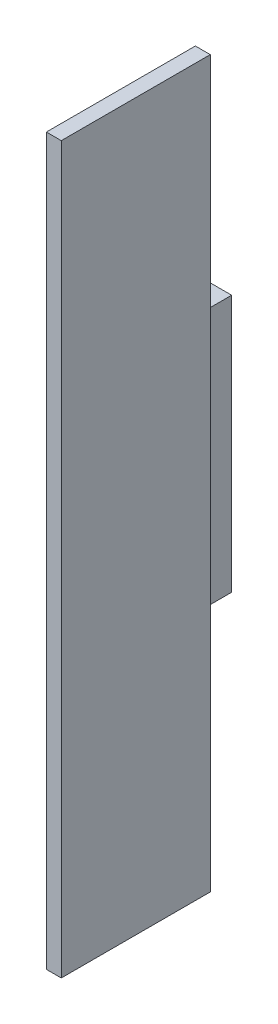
ISO-10303-21;
HEADER;
FILE_DESCRIPTION(('STEP AP214'),'2;1');
FILE_NAME('part.step','',(''),(''),'','','');
FILE_SCHEMA(('AUTOMOTIVE_DESIGN { 1 0 10303 214 1 1 1 1 }'));
ENDSEC;
DATA;
#1=APPLICATION_CONTEXT('core data for automotive mechanical design processes');
#2=APPLICATION_PROTOCOL_DEFINITION('international standard','automotive_design',2000,#1);
#3=PRODUCT_CONTEXT('',#1,'mechanical');
#4=PRODUCT('Part','Part','',(#3));
#5=PRODUCT_RELATED_PRODUCT_CATEGORY('part','',(#4));
#6=PRODUCT_DEFINITION_FORMATION('','',#4);
#7=PRODUCT_DEFINITION_CONTEXT('part definition',#1,'design');
#8=PRODUCT_DEFINITION('design','',#6,#7);
#9=PRODUCT_DEFINITION_SHAPE('','',#8);
#10=(LENGTH_UNIT() NAMED_UNIT(*) SI_UNIT(.MILLI.,.METRE.));
#11=(NAMED_UNIT(*) PLANE_ANGLE_UNIT() SI_UNIT($,.RADIAN.));
#12=(NAMED_UNIT(*) SI_UNIT($,.STERADIAN.) SOLID_ANGLE_UNIT());
#13=UNCERTAINTY_MEASURE_WITH_UNIT(LENGTH_MEASURE(1.E-05),#10,'distance_accuracy_value','');
#14=(GEOMETRIC_REPRESENTATION_CONTEXT(3) GLOBAL_UNCERTAINTY_ASSIGNED_CONTEXT((#13)) GLOBAL_UNIT_ASSIGNED_CONTEXT((#10,
#11,#12)) REPRESENTATION_CONTEXT('',''));
#15=CARTESIAN_POINT('',(0.,0.,0.));
#16=DIRECTION('',(0.,0.,1.));
#17=DIRECTION('',(1.,0.,0.));
#18=AXIS2_PLACEMENT_3D('',#15,#16,#17);
#19=CARTESIAN_POINT('',(0.,73.,30.));
#20=DIRECTION('',(-1.,0.,0.));
#21=DIRECTION('',(0.,-1.,0.));
#22=AXIS2_PLACEMENT_3D('',#19,#20,#21);
#23=PLANE('',#22);
#24=DIRECTION('',(0.,-1.,0.));
#25=VECTOR('',#24,1.);
#26=CARTESIAN_POINT('',(0.,-35.,7.69999999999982));
#27=LINE('',#26,#25);
#28=CARTESIAN_POINT('',(0.,35.,7.69999999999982));
#29=VERTEX_POINT('',#28);
#30=CARTESIAN_POINT('',(0.,-35.,7.69999999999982));
#31=VERTEX_POINT('',#30);
#32=EDGE_CURVE('E32',#29,#31,#27,.T.);
#33=ORIENTED_EDGE('',*,*,#32,.T.);
#34=DIRECTION('',(0.,0.,-1.));
#35=VECTOR('',#34,1.);
#36=CARTESIAN_POINT('',(0.,-35.,0.));
#37=LINE('',#36,#35);
#38=CARTESIAN_POINT('',(0.,-35.,0.));
#39=VERTEX_POINT('',#38);
#40=EDGE_CURVE('E18',#31,#39,#37,.T.);
#41=ORIENTED_EDGE('',*,*,#40,.T.);
#42=DIRECTION('',(0.,1.,0.));
#43=VECTOR('',#42,1.);
#44=CARTESIAN_POINT('',(0.,-73.,0.));
#45=LINE('',#44,#43);
#46=CARTESIAN_POINT('',(0.,-73.,0.));
#47=VERTEX_POINT('',#46);
#48=EDGE_CURVE('E178',#47,#39,#45,.T.);
#49=ORIENTED_EDGE('',*,*,#48,.F.);
#50=DIRECTION('',(0.,0.,-1.));
#51=VECTOR('',#50,1.);
#52=CARTESIAN_POINT('',(0.,-73.,30.));
#53=LINE('',#52,#51);
#54=CARTESIAN_POINT('',(0.,-73.,30.));
#55=VERTEX_POINT('',#54);
#56=EDGE_CURVE('E165',#55,#47,#53,.T.);
#57=ORIENTED_EDGE('',*,*,#56,.F.);
#58=DIRECTION('',(0.,-1.,0.));
#59=VECTOR('',#58,1.);
#60=CARTESIAN_POINT('',(0.,73.,30.));
#61=LINE('',#60,#59);
#62=CARTESIAN_POINT('',(0.,73.,30.));
#63=VERTEX_POINT('',#62);
#64=EDGE_CURVE('E155',#63,#55,#61,.T.);
#65=ORIENTED_EDGE('',*,*,#64,.F.);
#66=DIRECTION('',(0.,0.,1.));
#67=VECTOR('',#66,1.);
#68=CARTESIAN_POINT('',(0.,73.,0.));
#69=LINE('',#68,#67);
#70=CARTESIAN_POINT('',(0.,73.,0.));
#71=VERTEX_POINT('',#70);
#72=EDGE_CURVE('E170',#71,#63,#69,.T.);
#73=ORIENTED_EDGE('',*,*,#72,.F.);
#74=CARTESIAN_POINT('',(0.,34.9999999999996,0.));
#75=VERTEX_POINT('',#74);
#76=EDGE_CURVE('E167',#75,#71,#45,.T.);
#77=ORIENTED_EDGE('',*,*,#76,.F.);
#78=DIRECTION('',(0.,0.,1.));
#79=VECTOR('',#78,1.);
#80=CARTESIAN_POINT('',(0.,35.,7.69999999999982));
#81=LINE('',#80,#79);
#82=EDGE_CURVE('E125',#75,#29,#81,.T.);
#83=ORIENTED_EDGE('',*,*,#82,.T.);
#84=EDGE_LOOP('',(#33,#41,#49,#57,#65,#73,#77,#83));
#85=FACE_BOUND('',#84,.T.);
#86=ADVANCED_FACE('F14',(#85),#23,.T.);
#87=CARTESIAN_POINT('',(3.,73.,30.));
#88=DIRECTION('',(0.,0.,-1.));
#89=DIRECTION('',(0.,1.,0.));
#90=AXIS2_PLACEMENT_3D('',#87,#88,#89);
#91=PLANE('',#90);
#92=ORIENTED_EDGE('',*,*,#64,.T.);
#93=DIRECTION('',(-1.,0.,0.));
#94=VECTOR('',#93,1.);
#95=CARTESIAN_POINT('',(3.,-73.,30.));
#96=LINE('',#95,#94);
#97=CARTESIAN_POINT('',(3.,-73.,30.));
#98=VERTEX_POINT('',#97);
#99=EDGE_CURVE('E9',#98,#55,#96,.T.);
#100=ORIENTED_EDGE('',*,*,#99,.F.);
#101=DIRECTION('',(0.,-1.,0.));
#102=VECTOR('',#101,1.);
#103=CARTESIAN_POINT('',(3.,73.,30.));
#104=LINE('',#103,#102);
#105=CARTESIAN_POINT('',(3.,73.,30.));
#106=VERTEX_POINT('',#105);
#107=EDGE_CURVE('E196',#106,#98,#104,.T.);
#108=ORIENTED_EDGE('',*,*,#107,.F.);
#109=DIRECTION('',(-1.,0.,0.));
#110=VECTOR('',#109,1.);
#111=CARTESIAN_POINT('',(3.,73.,30.));
#112=LINE('',#111,#110);
#113=EDGE_CURVE('E193',#106,#63,#112,.T.);
#114=ORIENTED_EDGE('',*,*,#113,.T.);
#115=EDGE_LOOP('',(#92,#100,#108,#114));
#116=FACE_BOUND('',#115,.T.);
#117=ADVANCED_FACE('F16',(#116),#91,.F.);
#118=CARTESIAN_POINT('',(3.,-73.,30.));
#119=DIRECTION('',(0.,1.,0.));
#120=DIRECTION('',(-1.,0.,0.));
#121=AXIS2_PLACEMENT_3D('',#118,#119,#120);
#122=PLANE('',#121);
#123=ORIENTED_EDGE('',*,*,#56,.T.);
#124=DIRECTION('',(-1.,0.,0.));
#125=VECTOR('',#124,1.);
#126=CARTESIAN_POINT('',(3.,-73.,0.));
#127=LINE('',#126,#125);
#128=CARTESIAN_POINT('',(3.,-73.,0.));
#129=VERTEX_POINT('',#128);
#130=EDGE_CURVE('E24',#129,#47,#127,.T.);
#131=ORIENTED_EDGE('',*,*,#130,.F.);
#132=DIRECTION('',(0.,0.,-1.));
#133=VECTOR('',#132,1.);
#134=CARTESIAN_POINT('',(3.,-73.,30.));
#135=LINE('',#134,#133);
#136=EDGE_CURVE('E197',#98,#129,#135,.T.);
#137=ORIENTED_EDGE('',*,*,#136,.F.);
#138=ORIENTED_EDGE('',*,*,#99,.T.);
#139=EDGE_LOOP('',(#123,#131,#137,#138));
#140=FACE_BOUND('',#139,.T.);
#141=ADVANCED_FACE('F208',(#140),#122,.F.);
#142=CARTESIAN_POINT('',(3.,-73.,0.));
#143=DIRECTION('',(0.,0.,1.));
#144=DIRECTION('',(1.,0.,0.));
#145=AXIS2_PLACEMENT_3D('',#142,#143,#144);
#146=PLANE('',#145);
#147=ORIENTED_EDGE('',*,*,#48,.T.);
#148=DIRECTION('',(1.,0.,0.));
#149=VECTOR('',#148,1.);
#150=CARTESIAN_POINT('',(-6.,-35.,0.));
#151=LINE('',#150,#149);
#152=CARTESIAN_POINT('',(-6.,-35.,0.));
#153=VERTEX_POINT('',#152);
#154=EDGE_CURVE('E113',#153,#39,#151,.T.);
#155=ORIENTED_EDGE('',*,*,#154,.F.);
#156=DIRECTION('',(0.,1.,0.));
#157=VECTOR('',#156,1.);
#158=CARTESIAN_POINT('',(-6.,-35.,0.));
#159=LINE('',#158,#157);
#160=CARTESIAN_POINT('',(-6.,-25.9,0.));
#161=VERTEX_POINT('',#160);
#162=EDGE_CURVE('E136',#153,#161,#159,.T.);
#163=ORIENTED_EDGE('',*,*,#162,.T.);
#164=DIRECTION('',(1.,0.,0.));
#165=VECTOR('',#164,1.);
#166=CARTESIAN_POINT('',(-6.,-25.9,0.));
#167=LINE('',#166,#165);
#168=CARTESIAN_POINT('',(0.,-25.9,0.));
#169=VERTEX_POINT('',#168);
#170=EDGE_CURVE('E161',#161,#169,#167,.T.);
#171=ORIENTED_EDGE('',*,*,#170,.T.);
#172=CARTESIAN_POINT('',(0.,25.9,0.));
#173=VERTEX_POINT('',#172);
#174=EDGE_CURVE('E179',#169,#173,#45,.T.);
#175=ORIENTED_EDGE('',*,*,#174,.T.);
#176=DIRECTION('',(1.,0.,0.));
#177=VECTOR('',#176,1.);
#178=CARTESIAN_POINT('',(-6.,25.9,0.));
#179=LINE('',#178,#177);
#180=CARTESIAN_POINT('',(-6.,25.9,0.));
#181=VERTEX_POINT('',#180);
#182=EDGE_CURVE('E159',#181,#173,#179,.T.);
#183=ORIENTED_EDGE('',*,*,#182,.F.);
#184=DIRECTION('',(0.,1.,0.));
#185=VECTOR('',#184,1.);
#186=CARTESIAN_POINT('',(-6.,25.9,0.));
#187=LINE('',#186,#185);
#188=CARTESIAN_POINT('',(-6.,34.9999999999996,0.));
#189=VERTEX_POINT('',#188);
#190=EDGE_CURVE('E148',#181,#189,#187,.T.);
#191=ORIENTED_EDGE('',*,*,#190,.T.);
#192=DIRECTION('',(1.,0.,0.));
#193=VECTOR('',#192,1.);
#194=CARTESIAN_POINT('',(-6.,34.9999999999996,0.));
#195=LINE('',#194,#193);
#196=EDGE_CURVE('E156',#189,#75,#195,.T.);
#197=ORIENTED_EDGE('',*,*,#196,.T.);
#198=ORIENTED_EDGE('',*,*,#76,.T.);
#199=DIRECTION('',(-1.,0.,0.));
#200=VECTOR('',#199,1.);
#201=CARTESIAN_POINT('',(3.,73.,0.));
#202=LINE('',#201,#200);
#203=CARTESIAN_POINT('',(3.,73.,0.));
#204=VERTEX_POINT('',#203);
#205=EDGE_CURVE('E188',#204,#71,#202,.T.);
#206=ORIENTED_EDGE('',*,*,#205,.F.);
#207=DIRECTION('',(0.,1.,0.));
#208=VECTOR('',#207,1.);
#209=CARTESIAN_POINT('',(3.,-73.,0.));
#210=LINE('',#209,#208);
#211=EDGE_CURVE('E200',#129,#204,#210,.T.);
#212=ORIENTED_EDGE('',*,*,#211,.F.);
#213=ORIENTED_EDGE('',*,*,#130,.T.);
#214=EDGE_LOOP('',(#147,#155,#163,#171,#175,#183,#191,#197,#198,#206,#212,#213));
#215=FACE_BOUND('',#214,.T.);
#216=ADVANCED_FACE('F186',(#215),#146,.F.);
#217=CARTESIAN_POINT('',(3.,73.,0.));
#218=DIRECTION('',(0.,-1.,0.));
#219=DIRECTION('',(1.,0.,0.));
#220=AXIS2_PLACEMENT_3D('',#217,#218,#219);
#221=PLANE('',#220);
#222=ORIENTED_EDGE('',*,*,#72,.T.);
#223=ORIENTED_EDGE('',*,*,#113,.F.);
#224=DIRECTION('',(0.,0.,1.));
#225=VECTOR('',#224,1.);
#226=CARTESIAN_POINT('',(3.,73.,0.));
#227=LINE('',#226,#225);
#228=EDGE_CURVE('E40',#204,#106,#227,.T.);
#229=ORIENTED_EDGE('',*,*,#228,.F.);
#230=ORIENTED_EDGE('',*,*,#205,.T.);
#231=EDGE_LOOP('',(#222,#223,#229,#230));
#232=FACE_BOUND('',#231,.T.);
#233=ADVANCED_FACE('F191',(#232),#221,.F.);
#234=CARTESIAN_POINT('',(3.,73.,30.));
#235=DIRECTION('',(-1.,0.,0.));
#236=DIRECTION('',(0.,-1.,0.));
#237=AXIS2_PLACEMENT_3D('',#234,#235,#236);
#238=PLANE('',#237);
#239=ORIENTED_EDGE('',*,*,#107,.T.);
#240=ORIENTED_EDGE('',*,*,#136,.T.);
#241=ORIENTED_EDGE('',*,*,#211,.T.);
#242=ORIENTED_EDGE('',*,*,#228,.T.);
#243=EDGE_LOOP('',(#239,#240,#241,#242));
#244=FACE_BOUND('',#243,.T.);
#245=ADVANCED_FACE('F224',(#244),#238,.F.);
#246=CARTESIAN_POINT('',(0.,25.9,7.69999999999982));
#247=DIRECTION('',(1.,0.,0.));
#248=DIRECTION('',(0.,1.,0.));
#249=AXIS2_PLACEMENT_3D('',#246,#247,#248);
#250=PLANE('',#249);
#251=ORIENTED_EDGE('',*,*,#174,.F.);
#252=DIRECTION('',(0.,0.,-1.));
#253=VECTOR('',#252,1.);
#254=CARTESIAN_POINT('',(0.,-25.9,0.));
#255=LINE('',#254,#253);
#256=CARTESIAN_POINT('',(0.,-25.9,-7.30000000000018));
#257=VERTEX_POINT('',#256);
#258=EDGE_CURVE('E121',#169,#257,#255,.T.);
#259=ORIENTED_EDGE('',*,*,#258,.T.);
#260=DIRECTION('',(0.,1.,0.));
#261=VECTOR('',#260,1.);
#262=CARTESIAN_POINT('',(0.,-25.9,-7.30000000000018));
#263=LINE('',#262,#261);
#264=CARTESIAN_POINT('',(0.,25.9,-7.30000000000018));
#265=VERTEX_POINT('',#264);
#266=EDGE_CURVE('E129',#257,#265,#263,.T.);
#267=ORIENTED_EDGE('',*,*,#266,.T.);
#268=DIRECTION('',(0.,0.,1.));
#269=VECTOR('',#268,1.);
#270=CARTESIAN_POINT('',(0.,25.9,-7.30000000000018));
#271=LINE('',#270,#269);
#272=EDGE_CURVE('E132',#265,#173,#271,.T.);
#273=ORIENTED_EDGE('',*,*,#272,.T.);
#274=EDGE_LOOP('',(#251,#259,#267,#273));
#275=FACE_BOUND('',#274,.T.);
#276=ADVANCED_FACE('F227',(#275),#250,.T.);
#277=CARTESIAN_POINT('',(-6.,-35.,7.69999999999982));
#278=DIRECTION('',(0.,0.,1.));
#279=DIRECTION('',(1.,0.,0.));
#280=AXIS2_PLACEMENT_3D('',#277,#278,#279);
#281=PLANE('',#280);
#282=ORIENTED_EDGE('',*,*,#32,.F.);
#283=DIRECTION('',(1.,0.,0.));
#284=VECTOR('',#283,1.);
#285=CARTESIAN_POINT('',(-6.,35.,7.69999999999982));
#286=LINE('',#285,#284);
#287=CARTESIAN_POINT('',(-6.,35.,7.69999999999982));
#288=VERTEX_POINT('',#287);
#289=EDGE_CURVE('E153',#288,#29,#286,.T.);
#290=ORIENTED_EDGE('',*,*,#289,.F.);
#291=DIRECTION('',(0.,-1.,0.));
#292=VECTOR('',#291,1.);
#293=CARTESIAN_POINT('',(-6.,-35.,7.69999999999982));
#294=LINE('',#293,#292);
#295=CARTESIAN_POINT('',(-6.,-35.,7.69999999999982));
#296=VERTEX_POINT('',#295);
#297=EDGE_CURVE('E109',#288,#296,#294,.T.);
#298=ORIENTED_EDGE('',*,*,#297,.T.);
#299=DIRECTION('',(1.,0.,0.));
#300=VECTOR('',#299,1.);
#301=CARTESIAN_POINT('',(-6.,-35.,7.69999999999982));
#302=LINE('',#301,#300);
#303=EDGE_CURVE('E105',#296,#31,#302,.T.);
#304=ORIENTED_EDGE('',*,*,#303,.T.);
#305=EDGE_LOOP('',(#282,#290,#298,#304));
#306=FACE_BOUND('',#305,.T.);
#307=ADVANCED_FACE('F107',(#306),#281,.T.);
#308=CARTESIAN_POINT('',(-6.,35.,7.69999999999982));
#309=DIRECTION('',(0.,1.,0.));
#310=DIRECTION('',(0.,0.,1.));
#311=AXIS2_PLACEMENT_3D('',#308,#309,#310);
#312=PLANE('',#311);
#313=ORIENTED_EDGE('',*,*,#82,.F.);
#314=ORIENTED_EDGE('',*,*,#196,.F.);
#315=DIRECTION('',(0.,0.,1.));
#316=VECTOR('',#315,1.);
#317=CARTESIAN_POINT('',(-6.,35.,7.69999999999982));
#318=LINE('',#317,#316);
#319=EDGE_CURVE('E114',#189,#288,#318,.T.);
#320=ORIENTED_EDGE('',*,*,#319,.T.);
#321=ORIENTED_EDGE('',*,*,#289,.T.);
#322=EDGE_LOOP('',(#313,#314,#320,#321));
#323=FACE_BOUND('',#322,.T.);
#324=ADVANCED_FACE('F265',(#323),#312,.T.);
#325=CARTESIAN_POINT('',(-6.,25.9,-7.30000000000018));
#326=DIRECTION('',(0.,1.,0.));
#327=DIRECTION('',(-1.,0.,0.));
#328=AXIS2_PLACEMENT_3D('',#325,#326,#327);
#329=PLANE('',#328);
#330=ORIENTED_EDGE('',*,*,#272,.F.);
#331=DIRECTION('',(1.,0.,0.));
#332=VECTOR('',#331,1.);
#333=CARTESIAN_POINT('',(-6.,25.9,-7.30000000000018));
#334=LINE('',#333,#332);
#335=CARTESIAN_POINT('',(-6.,25.9,-7.30000000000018));
#336=VERTEX_POINT('',#335);
#337=EDGE_CURVE('E157',#336,#265,#334,.T.);
#338=ORIENTED_EDGE('',*,*,#337,.F.);
#339=DIRECTION('',(0.,0.,1.));
#340=VECTOR('',#339,1.);
#341=CARTESIAN_POINT('',(-6.,25.9,-7.30000000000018));
#342=LINE('',#341,#340);
#343=EDGE_CURVE('E145',#336,#181,#342,.T.);
#344=ORIENTED_EDGE('',*,*,#343,.T.);
#345=ORIENTED_EDGE('',*,*,#182,.T.);
#346=EDGE_LOOP('',(#330,#338,#344,#345));
#347=FACE_BOUND('',#346,.T.);
#348=ADVANCED_FACE('F272',(#347),#329,.T.);
#349=CARTESIAN_POINT('',(-6.,-25.9,-7.30000000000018));
#350=DIRECTION('',(0.,0.,-1.));
#351=DIRECTION('',(-1.,0.,0.));
#352=AXIS2_PLACEMENT_3D('',#349,#350,#351);
#353=PLANE('',#352);
#354=ORIENTED_EDGE('',*,*,#266,.F.);
#355=DIRECTION('',(1.,0.,0.));
#356=VECTOR('',#355,1.);
#357=CARTESIAN_POINT('',(-6.,-25.9,-7.30000000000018));
#358=LINE('',#357,#356);
#359=CARTESIAN_POINT('',(-6.,-25.9,-7.30000000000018));
#360=VERTEX_POINT('',#359);
#361=EDGE_CURVE('E160',#360,#257,#358,.T.);
#362=ORIENTED_EDGE('',*,*,#361,.F.);
#363=DIRECTION('',(0.,1.,0.));
#364=VECTOR('',#363,1.);
#365=CARTESIAN_POINT('',(-6.,-25.9,-7.30000000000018));
#366=LINE('',#365,#364);
#367=EDGE_CURVE('E142',#360,#336,#366,.T.);
#368=ORIENTED_EDGE('',*,*,#367,.T.);
#369=ORIENTED_EDGE('',*,*,#337,.T.);
#370=EDGE_LOOP('',(#354,#362,#368,#369));
#371=FACE_BOUND('',#370,.T.);
#372=ADVANCED_FACE('F281',(#371),#353,.T.);
#373=CARTESIAN_POINT('',(-6.,-25.9,0.));
#374=DIRECTION('',(0.,-1.,0.));
#375=DIRECTION('',(1.,0.,0.));
#376=AXIS2_PLACEMENT_3D('',#373,#374,#375);
#377=PLANE('',#376);
#378=ORIENTED_EDGE('',*,*,#258,.F.);
#379=ORIENTED_EDGE('',*,*,#170,.F.);
#380=DIRECTION('',(0.,0.,-1.));
#381=VECTOR('',#380,1.);
#382=CARTESIAN_POINT('',(-6.,-25.9,0.));
#383=LINE('',#382,#381);
#384=EDGE_CURVE('E139',#161,#360,#383,.T.);
#385=ORIENTED_EDGE('',*,*,#384,.T.);
#386=ORIENTED_EDGE('',*,*,#361,.T.);
#387=EDGE_LOOP('',(#378,#379,#385,#386));
#388=FACE_BOUND('',#387,.T.);
#389=ADVANCED_FACE('F290',(#388),#377,.T.);
#390=CARTESIAN_POINT('',(-6.,-35.,0.));
#391=DIRECTION('',(0.,-1.,0.));
#392=DIRECTION('',(1.,0.,0.));
#393=AXIS2_PLACEMENT_3D('',#390,#391,#392);
#394=PLANE('',#393);
#395=ORIENTED_EDGE('',*,*,#40,.F.);
#396=ORIENTED_EDGE('',*,*,#303,.F.);
#397=DIRECTION('',(0.,0.,-1.));
#398=VECTOR('',#397,1.);
#399=CARTESIAN_POINT('',(-6.,-35.,0.));
#400=LINE('',#399,#398);
#401=EDGE_CURVE('E134',#296,#153,#400,.T.);
#402=ORIENTED_EDGE('',*,*,#401,.T.);
#403=ORIENTED_EDGE('',*,*,#154,.T.);
#404=EDGE_LOOP('',(#395,#396,#402,#403));
#405=FACE_BOUND('',#404,.T.);
#406=ADVANCED_FACE('F117',(#405),#394,.T.);
#407=CARTESIAN_POINT('',(-6.,25.9,7.69999999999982));
#408=DIRECTION('',(1.,0.,0.));
#409=DIRECTION('',(0.,1.,0.));
#410=AXIS2_PLACEMENT_3D('',#407,#408,#409);
#411=PLANE('',#410);
#412=ORIENTED_EDGE('',*,*,#297,.F.);
#413=ORIENTED_EDGE('',*,*,#319,.F.);
#414=ORIENTED_EDGE('',*,*,#190,.F.);
#415=ORIENTED_EDGE('',*,*,#343,.F.);
#416=ORIENTED_EDGE('',*,*,#367,.F.);
#417=ORIENTED_EDGE('',*,*,#384,.F.);
#418=ORIENTED_EDGE('',*,*,#162,.F.);
#419=ORIENTED_EDGE('',*,*,#401,.F.);
#420=EDGE_LOOP('',(#412,#413,#414,#415,#416,#417,#418,#419));
#421=FACE_BOUND('',#420,.T.);
#422=ADVANCED_FACE('F307',(#421),#411,.F.);
#423=CLOSED_SHELL('',(#86,#117,#141,#216,#233,#245,#276,#307,#324,#348,#372,#389,#406,#422));
#424=MANIFOLD_SOLID_BREP('B1',#423);
#425=ADVANCED_BREP_SHAPE_REPRESENTATION('',(#18,#424),#14);
#426=SHAPE_DEFINITION_REPRESENTATION(#9,#425);
ENDSEC;
END-ISO-10303-21;
